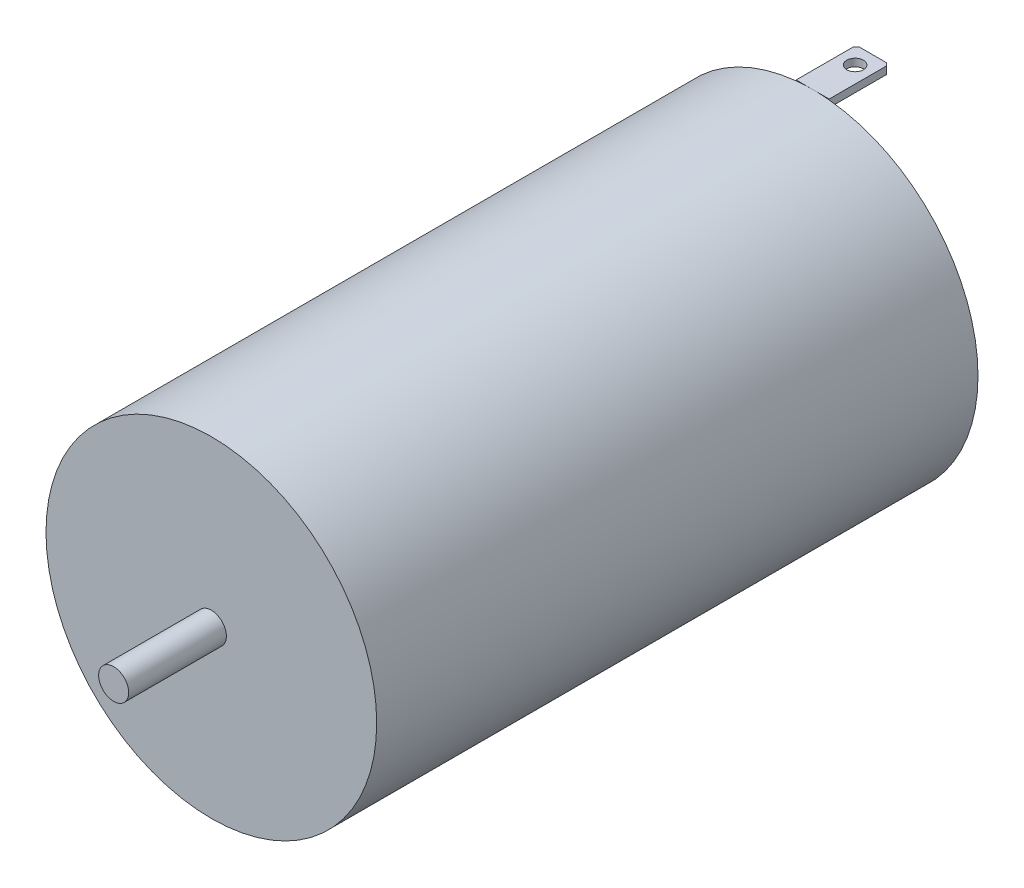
from build123d import *

# Parameters (mm, degrees)
SKETCH1_R                = 11
BASE_EXTRUDE_DEPTH       = 40
SKETCH2_R                = 1
BOSS_EXTRUDE1_DEPTH      = 6.5
SKETCH3_W                = 2.2
SKETCH3_H                = 4
SKETCH3_R                = 0.554374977
EXTRUDE1_DEPTH           = 0.5
CHAMFER1_SIZE            = 0.2
CHAMFER1_OF_MIRROR1_SIZE = 0.2


with BuildPart() as part:
    # Sketch1 → Base-Extrude (new body)
    with BuildSketch(Plane.XY):
        Circle(SKETCH1_R)
    extrude(amount=BASE_EXTRUDE_DEPTH)

    # Sketch2 → Boss-Extrude1 (add)
    with BuildSketch(Plane.XY.offset(40)):
        with Locations(Location((0, 0, 0), (0, 0, 180))):
            Circle(SKETCH2_R)
    extrude(amount=BOSS_EXTRUDE1_DEPTH)

    # Sketch3 → Extrude1 (add)
    with BuildSketch(Plane(origin=(0, -11, 20), x_dir=(-1, 0, 0), z_dir=(0, -1, 0))):
        with Locations((0, 22)):
            Rectangle(SKETCH3_W, SKETCH3_H)
        with Locations(Location((0, 22.824489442, 0), (0, 0, 180))):
            Circle(SKETCH3_R, mode=Mode.SUBTRACT)
    extrude1 = extrude(amount=-EXTRUDE1_DEPTH)

    # Chamfer1
    chamfer1_edges = [part.edges().sort_by_distance(p)[0] for p in [
        (1.1, -10.75, -4),
        (-1.1, -10.75, -4),
    ]]
    chamfer(chamfer1_edges, length=CHAMFER1_SIZE)

    # Mirror1: Extrude1 across plane
    add(extrude1.mirror(Plane.ZX))

    # Chamfer1 of Mirror1
    chamfer1_of_mirror1_edges = [part.edges().sort_by_distance(p)[0] for p in [
        (1.1, 10.75, -4),
        (-1.1, 10.75, -4),
    ]]
    chamfer(chamfer1_of_mirror1_edges, length=CHAMFER1_OF_MIRROR1_SIZE)


solid = part.part
